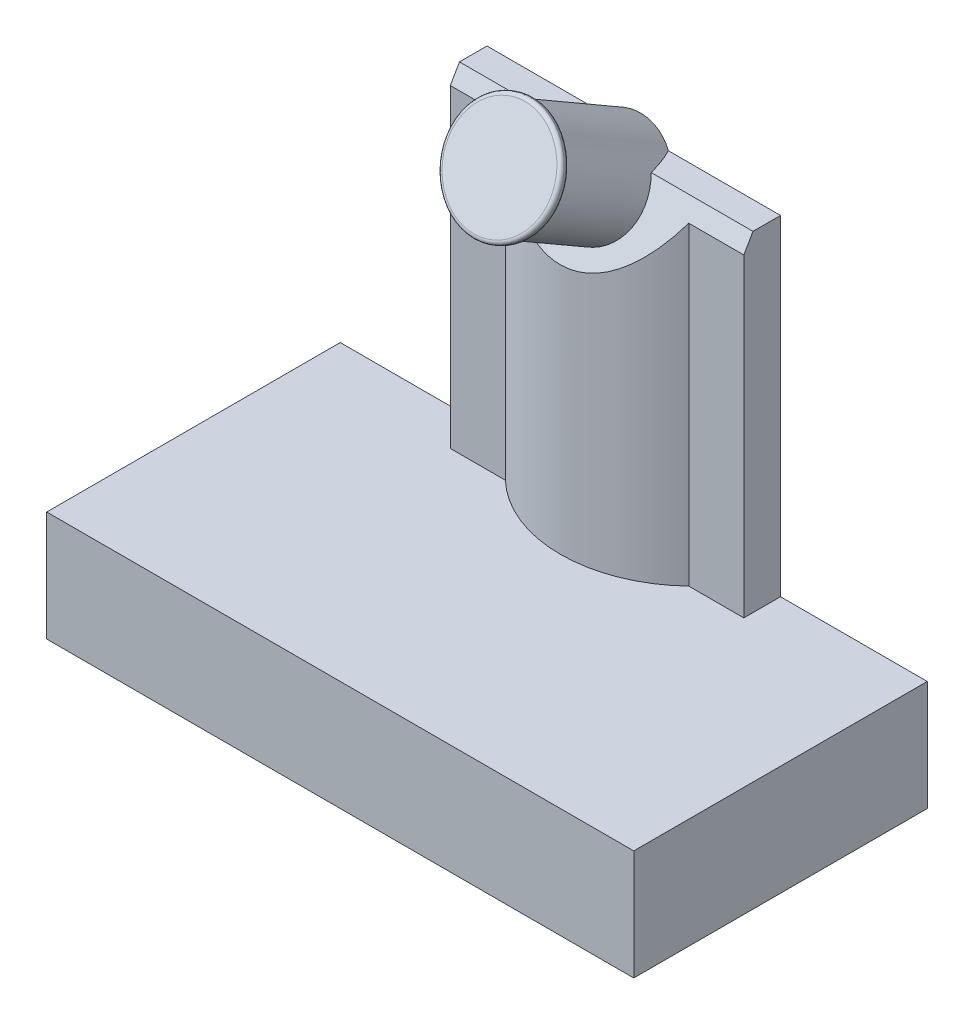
from build123d import *
from build123d.topology import SkipClean

# Parameters (mm, degrees)
ESQUISSE1_W             = 16
ESQUISSE1_H             = 8
BASE_EXTRUSION_DEPTH    = 1
ESQUISSE3_W             = 16
ESQUISSE3_H             = 8
ESQUISSE3_W_2           = 14
ESQUISSE3_H_2           = 6
BOSS_EXTRU_1_DEPTH      = 2
ESQUISSE4_R             = 1.5
ESQUISSE4_R_2           = 1
BOSS_EXTRU_2_DEPTH      = 2
BOSS_EXTRU_3_DEPTH      = 9
CHANFREIN1_SIZE         = 0.25
ESQUISSE7_W             = 10.109409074
ESQUISSE7_H             = 5.572776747
ENL_V_MAT_EXTRU_1_DEPTH = 1.205743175
ESQUISSE9_R             = 1.375
BOSS_EXTRU_4_DEPTH      = 0.649519
ESQUISSE10_R            = 1.375
BOSS_EXTRU_5_DEPTH      = 3
ESQUISSE11_R            = 1.5
BOSS_EXTRU_6_DEPTH      = 0.25
CONG_3_R                = 0.1


with BuildPart() as part:
    # Esquisse1 → Base-Extrusion (new body)
    with BuildSketch(Plane(origin=(0, 0, 0), x_dir=(1, 0, 0), z_dir=(0, 1, 0))):
        with Locations((8, -4)):
            Rectangle(ESQUISSE1_W, ESQUISSE1_H)
    extrude(amount=-BASE_EXTRUSION_DEPTH)

    # Esquisse3 → Boss.-Extru.1 (add)
    with BuildSketch(Plane.XZ.offset(1)):
        with Locations((8, 4)):
            Rectangle(ESQUISSE3_W, ESQUISSE3_H)
        with Locations((8, 4)):
            Rectangle(ESQUISSE3_W_2, ESQUISSE3_H_2, mode=Mode.SUBTRACT)
    extrude(amount=BOSS_EXTRU_1_DEPTH)

    # Esquisse4 → Boss.-Extru.2 (add)
    with BuildSketch(Plane.XZ.offset(1)):
        with Locations(Location((8, 4, 0), (0, 0, 90))):
            Circle(ESQUISSE4_R)
        with Locations(Location((8, 4, 0), (0, 0, 270))):
            Circle(ESQUISSE4_R_2, mode=Mode.SUBTRACT)
    extrude(amount=BOSS_EXTRU_2_DEPTH)

    # Esquisse5 → Boss.-Extru.3 (add)
    with BuildSketch(Plane(origin=(0, 0, 0), x_dir=(-1, 0, 0), z_dir=(0, 1, 0))):
        with BuildLine():
            Line((-4, 0), (-12, 0))
            Line((-12, 0), (-12, 1))
            Line((-12, 1), (-10.5, 1))
            ThreePointArc((-10.5, 1), (-8, 2), (-5.5, 1))
            Line((-5.5, 1), (-4, 1))
            Line((-4, 1), (-4, 0))
        make_face()
    extrude(amount=BOSS_EXTRU_3_DEPTH)

    # Chanfrein1
    chanfrein1_edges = [part.edges().sort_by_distance(p)[0] for p in [
        (4.75, 9, 1),
        (11.25, 9, 1),
    ]]
    chamfer(chanfrein1_edges, length=CHANFREIN1_SIZE)

    # Esquisse7 → Enl_v. mat.-Extru.1 (cut)
    with BuildSketch(Plane(origin=(0, 2.574759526, 4.459614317), x_dir=(1, 0, 0), z_dir=(0, -0.5000000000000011, -0.8660254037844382))):
        with Locations((7.635949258, -5.974848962)):
            Rectangle(ESQUISSE7_W, ESQUISSE7_H)
    extrude(amount=-ENL_V_MAT_EXTRU_1_DEPTH, mode=Mode.SUBTRACT)

    # Esquisse9 → Boss.-Extru.4 (add)
    with BuildSketch(Plane(origin=(0, 2.25, 3.897114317), x_dir=(-1, 0, 0), z_dir=(0, -0.500000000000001, -0.8660254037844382))):
        with Locations((-8, 6.794228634)):
            Circle(ESQUISSE9_R)
    extrude(amount=-BOSS_EXTRU_4_DEPTH)

    # Esquisse10 → Boss.-Extru.5 (add)
    with SkipClean():  # the faces are left unmerged after this step: merging them gives an invalid solid
        with BuildSketch(Plane(origin=(0, 2.574759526, 4.459614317), x_dir=(1, 0, 0), z_dir=(0, 0.5000000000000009, 0.866025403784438))):
            with Locations(Location((8, 6.794228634, 0), (0, 0, 46.658241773))):
                Circle(ESQUISSE10_R)
        extrude(amount=BOSS_EXTRU_5_DEPTH)

    # Esquisse11 → Boss.-Extru.6 (add)
    with SkipClean():  # the faces are left unmerged after this step: merging them gives an invalid solid
        with BuildSketch(Plane(origin=(0, 4.074759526, 7.057690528), x_dir=(1, 0, 0), z_dir=(0, 0.5000000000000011, 0.8660254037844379))):
            with Locations(Location((8, 6.794228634, 0), (0, 0, 270))):
                Circle(ESQUISSE11_R)
        extrude(amount=-BOSS_EXTRU_6_DEPTH)

    # Cong_3
    cong_3_edges = [part.edges().sort_by_distance(p)[0] for p in [
        (8, 11.132772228, 2.69406986),
        (8, 11.257772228, 2.910576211),
    ]]
    fillet(cong_3_edges, radius=CONG_3_R)


solid = part.part
